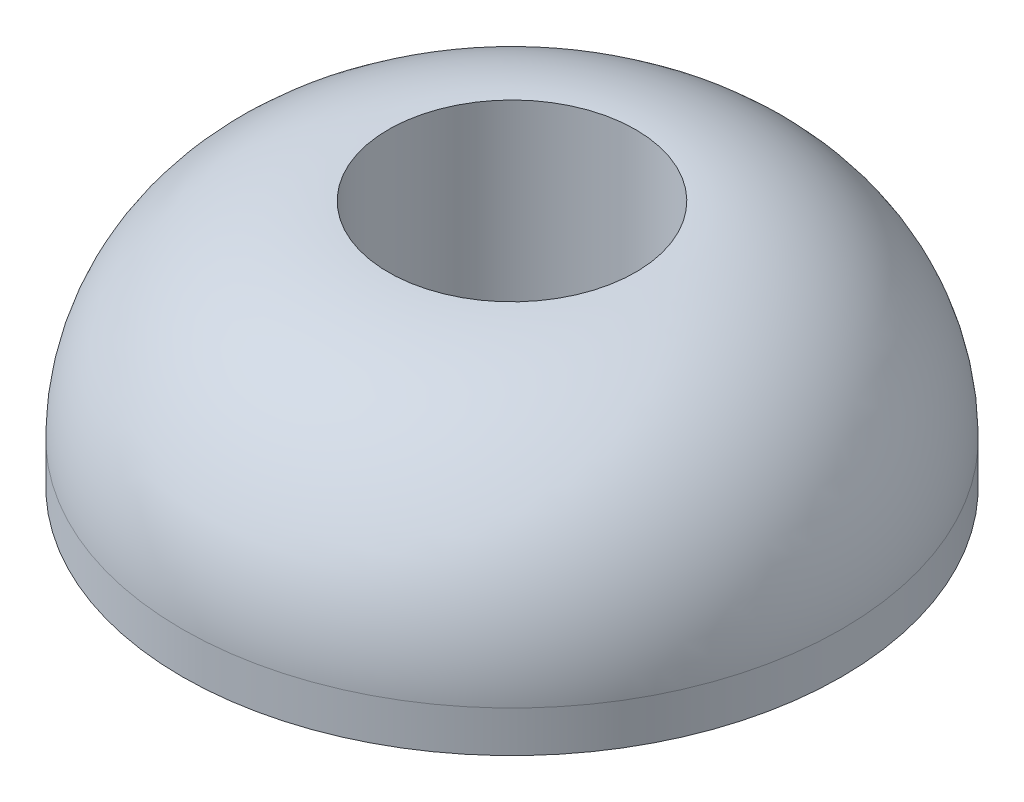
from build123d import *


with BuildPart() as part:
    # Esquisse1 → R_vol.-Mince2 (revolve)
    with BuildSketch(Plane.XY, mode=Mode.PRIVATE) as r_vol_mince2_sk:
        with BuildLine():
            Line((3, 1), (3, 6))
            ThreePointArc((3, 6), (6.535533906, 4.535533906), (8, 1))
            Line((8, 1), (8, 0))
            Line((8, 0), (6.7, 0))
            Line((6.7, 0), (6.7, 1))
            ThreePointArc((6.7, 1), (6.041381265, 3.107130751), (4.3, 4.464101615))
            Line((4.3, 4.464101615), (4.3, 1))
            Line((4.3, 1), (3, 1))
        make_face()
    revolve(r_vol_mince2_sk.sketch.rotate(Axis((0, -4.452651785, 0), (0, 1, 0)), 90), axis=Axis((0, -4.452651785, 0), (0, 1, 0)))


solid = part.part
